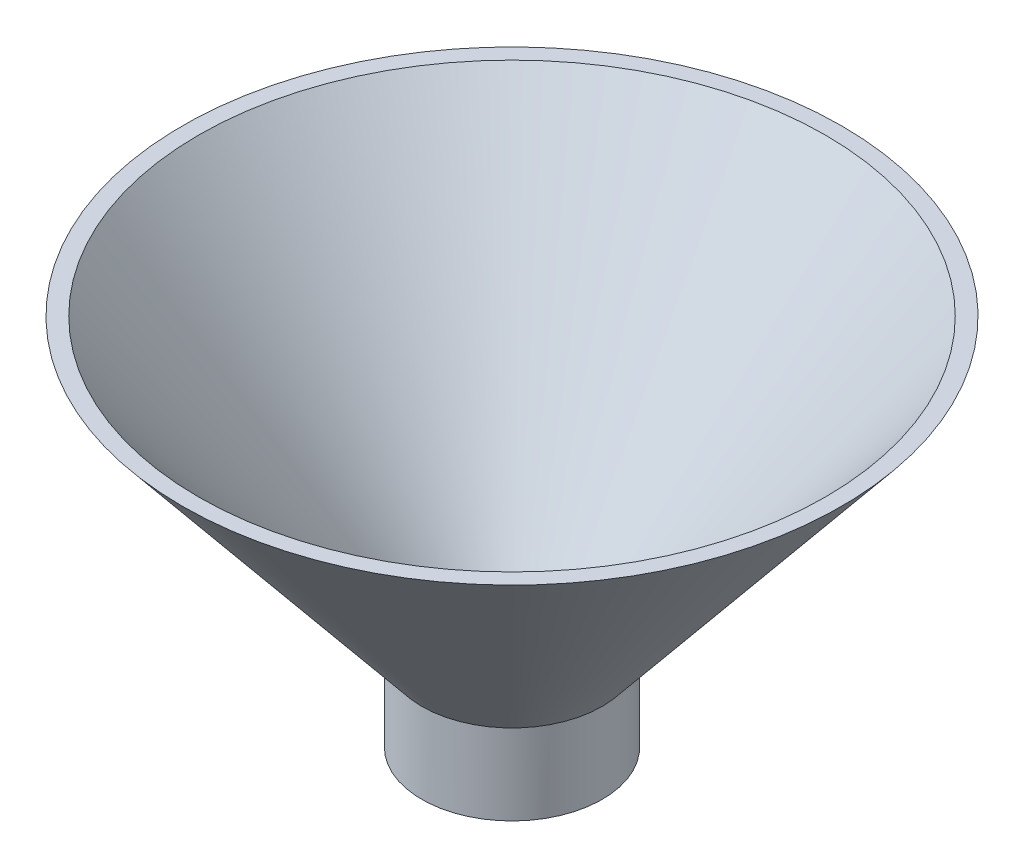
ISO-10303-21;
HEADER;
FILE_DESCRIPTION(('STEP AP214'),'2;1');
FILE_NAME('part.step','',(''),(''),'','','');
FILE_SCHEMA(('AUTOMOTIVE_DESIGN { 1 0 10303 214 1 1 1 1 }'));
ENDSEC;
DATA;
#1=APPLICATION_CONTEXT('core data for automotive mechanical design processes');
#2=APPLICATION_PROTOCOL_DEFINITION('international standard','automotive_design',2000,#1);
#3=PRODUCT_CONTEXT('',#1,'mechanical');
#4=PRODUCT('Part','Part','',(#3));
#5=PRODUCT_RELATED_PRODUCT_CATEGORY('part','',(#4));
#6=PRODUCT_DEFINITION_FORMATION('','',#4);
#7=PRODUCT_DEFINITION_CONTEXT('part definition',#1,'design');
#8=PRODUCT_DEFINITION('design','',#6,#7);
#9=PRODUCT_DEFINITION_SHAPE('','',#8);
#10=(LENGTH_UNIT() NAMED_UNIT(*) SI_UNIT(.MILLI.,.METRE.));
#11=(NAMED_UNIT(*) PLANE_ANGLE_UNIT() SI_UNIT($,.RADIAN.));
#12=(NAMED_UNIT(*) SI_UNIT($,.STERADIAN.) SOLID_ANGLE_UNIT());
#13=UNCERTAINTY_MEASURE_WITH_UNIT(LENGTH_MEASURE(1.E-05),#10,'distance_accuracy_value','');
#14=(GEOMETRIC_REPRESENTATION_CONTEXT(3) GLOBAL_UNCERTAINTY_ASSIGNED_CONTEXT((#13)) GLOBAL_UNIT_ASSIGNED_CONTEXT((#10,
#11,#12)) REPRESENTATION_CONTEXT('',''));
#15=CARTESIAN_POINT('',(0.,0.,0.));
#16=DIRECTION('',(0.,0.,1.));
#17=DIRECTION('',(1.,0.,0.));
#18=AXIS2_PLACEMENT_3D('',#15,#16,#17);
#19=CARTESIAN_POINT('',(7.82569741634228,11.8312531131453,0.));
#20=DIRECTION('',(0.,-1.,0.));
#21=DIRECTION('',(0.,0.,-1.));
#22=AXIS2_PLACEMENT_3D('',#19,#20,#21);
#23=PLANE('',#22);
#24=CARTESIAN_POINT('',(0.,11.8312531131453,0.));
#25=DIRECTION('',(0.,-1.,0.));
#26=DIRECTION('',(0.,0.,-1.));
#27=AXIS2_PLACEMENT_3D('',#24,#25,#26);
#28=CIRCLE('',#27,7.82569741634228);
#29=CARTESIAN_POINT('',(0.,11.8312531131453,-7.82569741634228));
#30=VERTEX_POINT('',#29);
#31=EDGE_CURVE('E50',#30,#30,#28,.T.);
#32=ORIENTED_EDGE('',*,*,#31,.T.);
#33=EDGE_LOOP('',(#32));
#34=FACE_BOUND('',#33,.T.);
#35=CARTESIAN_POINT('',(0.,11.8312531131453,0.));
#36=DIRECTION('',(0.,-1.,0.));
#37=DIRECTION('',(0.,0.,-1.));
#38=AXIS2_PLACEMENT_3D('',#35,#36,#37);
#39=CIRCLE('',#38,6.35);
#40=CARTESIAN_POINT('',(0.,11.8312531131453,-6.35));
#41=VERTEX_POINT('',#40);
#42=EDGE_CURVE('E10',#41,#41,#39,.T.);
#43=ORIENTED_EDGE('',*,*,#42,.F.);
#44=EDGE_LOOP('',(#43));
#45=FACE_BOUND('',#44,.T.);
#46=ADVANCED_FACE('F28',(#34,#45),#23,.T.);
#47=CARTESIAN_POINT('',(0.,18.2519502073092,0.));
#48=DIRECTION('',(0.,-1.,0.));
#49=DIRECTION('',(0.,0.,-1.));
#50=AXIS2_PLACEMENT_3D('',#47,#48,#49);
#51=CYLINDRICAL_SURFACE('',#50,6.35);
#52=ORIENTED_EDGE('',*,*,#42,.T.);
#53=EDGE_LOOP('',(#52));
#54=FACE_BOUND('',#53,.T.);
#55=CARTESIAN_POINT('',(0.,18.8162531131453,0.));
#56=DIRECTION('',(0.,-1.,0.));
#57=DIRECTION('',(0.,0.,-1.));
#58=AXIS2_PLACEMENT_3D('',#55,#56,#57);
#59=CIRCLE('',#58,6.35);
#60=CARTESIAN_POINT('',(0.,18.8162531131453,6.35));
#61=VERTEX_POINT('',#60);
#62=EDGE_CURVE('E34',#61,#61,#59,.T.);
#63=ORIENTED_EDGE('',*,*,#62,.F.);
#64=EDGE_LOOP('',(#63));
#65=FACE_BOUND('',#64,.T.);
#66=ADVANCED_FACE('F68',(#54,#65),#51,.F.);
#67=CARTESIAN_POINT('',(0.,44.2162531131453,0.));
#68=DIRECTION('',(0.,1.,0.));
#69=DIRECTION('',(0.,0.,1.));
#70=AXIS2_PLACEMENT_3D('',#67,#68,#69);
#71=CONICAL_SURFACE('',#70,27.178,0.686817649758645);
#72=CARTESIAN_POINT('',(0.,44.2162531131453,0.));
#73=DIRECTION('',(0.,-1.,0.));
#74=DIRECTION('',(0.,0.,-1.));
#75=AXIS2_PLACEMENT_3D('',#72,#73,#74);
#76=CIRCLE('',#75,27.178);
#77=CARTESIAN_POINT('',(0.,44.2162531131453,27.178));
#78=VERTEX_POINT('',#77);
#79=EDGE_CURVE('E38',#78,#78,#76,.T.);
#80=CARTESIAN_POINT('',(0.,18.8162531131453,6.35));
#81=CARTESIAN_POINT('',(0.,19.0808364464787,6.56695833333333));
#82=CARTESIAN_POINT('',(0.,19.345419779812,6.78391666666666));
#83=CARTESIAN_POINT('',(0.,19.8745864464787,7.21783333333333));
#84=CARTESIAN_POINT('',(0.,20.139169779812,7.43479166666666));
#85=CARTESIAN_POINT('',(0.,20.6683364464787,7.86870833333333));
#86=CARTESIAN_POINT('',(0.,20.932919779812,8.08566666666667));
#87=CARTESIAN_POINT('',(0.,21.4620864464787,8.51958333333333));
#88=CARTESIAN_POINT('',(0.,21.726669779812,8.73654166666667));
#89=CARTESIAN_POINT('',(0.,22.2558364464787,9.17045833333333));
#90=CARTESIAN_POINT('',(0.,22.520419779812,9.38741666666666));
#91=CARTESIAN_POINT('',(0.,23.0495864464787,9.82133333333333));
#92=CARTESIAN_POINT('',(0.,23.314169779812,10.0382916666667));
#93=CARTESIAN_POINT('',(0.,23.8433364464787,10.4722083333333));
#94=CARTESIAN_POINT('',(0.,24.107919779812,10.6891666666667));
#95=CARTESIAN_POINT('',(0.,24.6370864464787,11.1230833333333));
#96=CARTESIAN_POINT('',(0.,24.901669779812,11.3400416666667));
#97=CARTESIAN_POINT('',(0.,25.4308364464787,11.7739583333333));
#98=CARTESIAN_POINT('',(0.,25.695419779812,11.9909166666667));
#99=CARTESIAN_POINT('',(0.,26.2245864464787,12.4248333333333));
#100=CARTESIAN_POINT('',(0.,26.489169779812,12.6417916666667));
#101=CARTESIAN_POINT('',(0.,27.0183364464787,13.0757083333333));
#102=CARTESIAN_POINT('',(0.,27.282919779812,13.2926666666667));
#103=CARTESIAN_POINT('',(0.,27.8120864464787,13.7265833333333));
#104=CARTESIAN_POINT('',(0.,28.076669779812,13.9435416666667));
#105=CARTESIAN_POINT('',(0.,28.6058364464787,14.3774583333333));
#106=CARTESIAN_POINT('',(0.,28.870419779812,14.5944166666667));
#107=CARTESIAN_POINT('',(0.,29.3995864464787,15.0283333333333));
#108=CARTESIAN_POINT('',(0.,29.664169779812,15.2452916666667));
#109=CARTESIAN_POINT('',(0.,30.1933364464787,15.6792083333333));
#110=CARTESIAN_POINT('',(0.,30.457919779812,15.8961666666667));
#111=CARTESIAN_POINT('',(0.,30.9870864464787,16.3300833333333));
#112=CARTESIAN_POINT('',(0.,31.251669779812,16.5470416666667));
#113=CARTESIAN_POINT('',(0.,31.7808364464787,16.9809583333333));
#114=CARTESIAN_POINT('',(0.,32.045419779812,17.1979166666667));
#115=CARTESIAN_POINT('',(0.,32.5745864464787,17.6318333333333));
#116=CARTESIAN_POINT('',(0.,32.839169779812,17.8487916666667));
#117=CARTESIAN_POINT('',(0.,33.3683364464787,18.2827083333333));
#118=CARTESIAN_POINT('',(0.,33.632919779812,18.4996666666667));
#119=CARTESIAN_POINT('',(0.,34.1620864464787,18.9335833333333));
#120=CARTESIAN_POINT('',(0.,34.426669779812,19.1505416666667));
#121=CARTESIAN_POINT('',(0.,34.9558364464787,19.5844583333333));
#122=CARTESIAN_POINT('',(0.,35.220419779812,19.8014166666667));
#123=CARTESIAN_POINT('',(0.,35.7495864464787,20.2353333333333));
#124=CARTESIAN_POINT('',(0.,36.014169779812,20.4522916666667));
#125=CARTESIAN_POINT('',(0.,36.5433364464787,20.8862083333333));
#126=CARTESIAN_POINT('',(0.,36.807919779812,21.1031666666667));
#127=CARTESIAN_POINT('',(0.,37.3370864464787,21.5370833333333));
#128=CARTESIAN_POINT('',(0.,37.601669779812,21.7540416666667));
#129=CARTESIAN_POINT('',(0.,38.1308364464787,22.1879583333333));
#130=CARTESIAN_POINT('',(0.,38.395419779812,22.4049166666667));
#131=CARTESIAN_POINT('',(0.,38.9245864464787,22.8388333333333));
#132=CARTESIAN_POINT('',(0.,39.189169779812,23.0557916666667));
#133=CARTESIAN_POINT('',(0.,39.7183364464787,23.4897083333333));
#134=CARTESIAN_POINT('',(0.,39.982919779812,23.7066666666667));
#135=CARTESIAN_POINT('',(0.,40.5120864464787,24.1405833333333));
#136=CARTESIAN_POINT('',(0.,40.776669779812,24.3575416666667));
#137=CARTESIAN_POINT('',(0.,41.3058364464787,24.7914583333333));
#138=CARTESIAN_POINT('',(0.,41.570419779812,25.0084166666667));
#139=CARTESIAN_POINT('',(0.,42.0995864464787,25.4423333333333));
#140=CARTESIAN_POINT('',(0.,42.364169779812,25.6592916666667));
#141=CARTESIAN_POINT('',(0.,42.8933364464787,26.0932083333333));
#142=CARTESIAN_POINT('',(0.,43.157919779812,26.3101666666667));
#143=CARTESIAN_POINT('',(0.,43.6870864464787,26.7440833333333));
#144=CARTESIAN_POINT('',(0.,43.951669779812,26.9610416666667));
#145=CARTESIAN_POINT('',(0.,44.2162531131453,27.178));
#146=B_SPLINE_CURVE_WITH_KNOTS('',3,(#80,#81,#82,#83,#84,#85,#86,#87,#88,#89,#90,#91,#92,#93,
#94,#95,#96,#97,#98,#99,#100,#101,#102,#103,#104,#105,#106,#107,#108,#109,#110,#111,#112,#113,
#114,#115,#116,#117,#118,#119,#120,#121,#122,#123,#124,#125,#126,#127,#128,#129,#130,#131,#132,
#133,#134,#135,#136,#137,#138,#139,#140,#141,#142,#143,#144,#145),.UNSPECIFIED.,.F.,.F.,(4,2,2,
2,2,2,2,2,2,2,2,2,2,2,2,2,2,2,2,2,2,2,2,2,2,2,2,2,2,2,2,2,4),(0.,1.02648786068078,
2.05297572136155,3.07946358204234,4.10595144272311,5.13243930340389,6.15892716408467,
7.18541502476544,8.21190288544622,9.238390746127,10.2648786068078,11.2913664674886,
12.3178543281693,13.3443421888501,14.3708300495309,15.3973179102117,16.4238057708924,
17.4502936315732,18.476781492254,19.5032693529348,20.5297572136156,21.5562450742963,
22.5827329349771,23.6092207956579,24.6357086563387,25.6621965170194,26.6886843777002,
27.715172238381,28.7416600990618,29.7681479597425,30.7946358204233,31.8211236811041,
32.8476115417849),.UNSPECIFIED.);
#147=EDGE_CURVE('BSEAM72',#61,#78,#146,.T.);
#148=ORIENTED_EDGE('',*,*,#62,.T.);
#149=ORIENTED_EDGE('',*,*,#79,.F.);
#150=ORIENTED_EDGE('',*,*,#147,.T.);
#151=ORIENTED_EDGE('',*,*,#147,.F.);
#152=EDGE_LOOP('',(#148,#150,#149,#151));
#153=FACE_BOUND('',#152,.T.);
#154=ADVANCED_FACE('F72',(#153),#71,.F.);
#155=CARTESIAN_POINT('',(27.178,44.2162531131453,0.));
#156=DIRECTION('',(0.,1.,0.));
#157=DIRECTION('',(0.,0.,1.));
#158=AXIS2_PLACEMENT_3D('',#155,#156,#157);
#159=PLANE('',#158);
#160=ORIENTED_EDGE('',*,*,#79,.T.);
#161=EDGE_LOOP('',(#160));
#162=FACE_BOUND('',#161,.T.);
#163=CARTESIAN_POINT('',(0.,44.2162531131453,0.));
#164=DIRECTION('',(0.,-1.,0.));
#165=DIRECTION('',(0.,0.,-1.));
#166=AXIS2_PLACEMENT_3D('',#163,#164,#165);
#167=CIRCLE('',#166,28.575);
#168=CARTESIAN_POINT('',(0.,44.2162531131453,28.575));
#169=VERTEX_POINT('',#168);
#170=EDGE_CURVE('E42',#169,#169,#167,.T.);
#171=ORIENTED_EDGE('',*,*,#170,.F.);
#172=EDGE_LOOP('',(#171));
#173=FACE_BOUND('',#172,.T.);
#174=ADVANCED_FACE('F64',(#162,#173),#159,.T.);
#175=CARTESIAN_POINT('',(0.,18.8162531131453,0.));
#176=DIRECTION('',(0.,1.,0.));
#177=DIRECTION('',(0.,0.,1.));
#178=AXIS2_PLACEMENT_3D('',#175,#176,#177);
#179=CONICAL_SURFACE('',#178,7.82569741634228,0.68496221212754);
#180=CARTESIAN_POINT('',(0.,18.8162531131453,0.));
#181=DIRECTION('',(0.,-1.,0.));
#182=DIRECTION('',(0.,0.,-1.));
#183=AXIS2_PLACEMENT_3D('',#180,#181,#182);
#184=CIRCLE('',#183,7.82569741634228);
#185=CARTESIAN_POINT('',(0.,18.8162531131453,7.82569741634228));
#186=VERTEX_POINT('',#185);
#187=EDGE_CURVE('E47',#186,#186,#184,.T.);
#188=CARTESIAN_POINT('',(0.,44.2162531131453,28.575));
#189=CARTESIAN_POINT('',(0.,43.951669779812,28.3588614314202));
#190=CARTESIAN_POINT('',(0.,43.6870864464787,28.1427228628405));
#191=CARTESIAN_POINT('',(0.,43.157919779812,27.7104457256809));
#192=CARTESIAN_POINT('',(0.,42.8933364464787,27.4943071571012));
#193=CARTESIAN_POINT('',(0.,42.364169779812,27.0620300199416));
#194=CARTESIAN_POINT('',(0.,42.0995864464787,26.8458914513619));
#195=CARTESIAN_POINT('',(0.,41.570419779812,26.4136143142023));
#196=CARTESIAN_POINT('',(0.,41.3058364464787,26.1974757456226));
#197=CARTESIAN_POINT('',(0.,40.776669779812,25.765198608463));
#198=CARTESIAN_POINT('',(0.,40.5120864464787,25.5490600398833));
#199=CARTESIAN_POINT('',(0.,39.982919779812,25.1167829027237));
#200=CARTESIAN_POINT('',(0.,39.7183364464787,24.9006443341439));
#201=CARTESIAN_POINT('',(0.,39.189169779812,24.4683671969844));
#202=CARTESIAN_POINT('',(0.,38.9245864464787,24.2522286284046));
#203=CARTESIAN_POINT('',(0.,38.395419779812,23.8199514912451));
#204=CARTESIAN_POINT('',(0.,38.1308364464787,23.6038129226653));
#205=CARTESIAN_POINT('',(0.,37.601669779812,23.1715357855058));
#206=CARTESIAN_POINT('',(0.,37.3370864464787,22.955397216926));
#207=CARTESIAN_POINT('',(0.,36.807919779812,22.5231200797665));
#208=CARTESIAN_POINT('',(0.,36.5433364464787,22.3069815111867));
#209=CARTESIAN_POINT('',(0.,36.014169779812,21.8747043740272));
#210=CARTESIAN_POINT('',(0.,35.7495864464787,21.6585658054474));
#211=CARTESIAN_POINT('',(0.,35.220419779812,21.2262886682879));
#212=CARTESIAN_POINT('',(0.,34.9558364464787,21.0101500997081));
#213=CARTESIAN_POINT('',(0.,34.426669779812,20.5778729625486));
#214=CARTESIAN_POINT('',(0.,34.1620864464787,20.3617343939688));
#215=CARTESIAN_POINT('',(0.,33.632919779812,19.9294572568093));
#216=CARTESIAN_POINT('',(0.,33.3683364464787,19.7133186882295));
#217=CARTESIAN_POINT('',(0.,32.839169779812,19.28104155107));
#218=CARTESIAN_POINT('',(0.,32.5745864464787,19.0649029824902));
#219=CARTESIAN_POINT('',(0.,32.045419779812,18.6326258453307));
#220=CARTESIAN_POINT('',(0.,31.7808364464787,18.4164872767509));
#221=CARTESIAN_POINT('',(0.,31.251669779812,17.9842101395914));
#222=CARTESIAN_POINT('',(0.,30.9870864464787,17.7680715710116));
#223=CARTESIAN_POINT('',(0.,30.457919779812,17.3357944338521));
#224=CARTESIAN_POINT('',(0.,30.1933364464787,17.1196558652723));
#225=CARTESIAN_POINT('',(0.,29.664169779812,16.6873787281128));
#226=CARTESIAN_POINT('',(0.,29.3995864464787,16.471240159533));
#227=CARTESIAN_POINT('',(0.,28.870419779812,16.0389630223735));
#228=CARTESIAN_POINT('',(0.,28.6058364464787,15.8228244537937));
#229=CARTESIAN_POINT('',(0.,28.076669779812,15.3905473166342));
#230=CARTESIAN_POINT('',(0.,27.8120864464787,15.1744087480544));
#231=CARTESIAN_POINT('',(0.,27.282919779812,14.7421316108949));
#232=CARTESIAN_POINT('',(0.,27.0183364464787,14.5259930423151));
#233=CARTESIAN_POINT('',(0.,26.489169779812,14.0937159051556));
#234=CARTESIAN_POINT('',(0.,26.2245864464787,13.8775773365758));
#235=CARTESIAN_POINT('',(0.,25.695419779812,13.4453001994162));
#236=CARTESIAN_POINT('',(0.,25.4308364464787,13.2291616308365));
#237=CARTESIAN_POINT('',(0.,24.901669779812,12.7968844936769));
#238=CARTESIAN_POINT('',(0.,24.6370864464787,12.5807459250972));
#239=CARTESIAN_POINT('',(0.,24.107919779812,12.1484687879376));
#240=CARTESIAN_POINT('',(0.,23.8433364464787,11.9323302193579));
#241=CARTESIAN_POINT('',(0.,23.314169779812,11.5000530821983));
#242=CARTESIAN_POINT('',(0.,23.0495864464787,11.2839145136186));
#243=CARTESIAN_POINT('',(0.,22.520419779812,10.851637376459));
#244=CARTESIAN_POINT('',(0.,22.2558364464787,10.6354988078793));
#245=CARTESIAN_POINT('',(0.,21.726669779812,10.2032216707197));
#246=CARTESIAN_POINT('',(0.,21.4620864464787,9.98708310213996));
#247=CARTESIAN_POINT('',(0.,20.932919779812,9.55480596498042));
#248=CARTESIAN_POINT('',(0.,20.6683364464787,9.33866739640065));
#249=CARTESIAN_POINT('',(0.,20.139169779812,8.90639025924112));
#250=CARTESIAN_POINT('',(0.,19.8745864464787,8.69025169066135));
#251=CARTESIAN_POINT('',(0.,19.345419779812,8.25797455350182));
#252=CARTESIAN_POINT('',(0.,19.0808364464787,8.04183598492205));
#253=CARTESIAN_POINT('',(0.,18.8162531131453,7.82569741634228));
#254=B_SPLINE_CURVE_WITH_KNOTS('',3,(#188,#189,#190,#191,#192,#193,#194,#195,#196,#197,#198,
#199,#200,#201,#202,#203,#204,#205,#206,#207,#208,#209,#210,#211,#212,#213,#214,#215,#216,#217,
#218,#219,#220,#221,#222,#223,#224,#225,#226,#227,#228,#229,#230,#231,#232,#233,#234,#235,#236,
#237,#238,#239,#240,#241,#242,#243,#244,#245,#246,#247,#248,#249,#250,#251,#252,#253),
.UNSPECIFIED.,.F.,.F.,(4,2,2,2,2,2,2,2,2,2,2,2,2,2,2,2,2,2,2,2,2,2,2,2,2,2,2,2,2,2,2,2,4),(0.,
1.0249302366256,2.04986047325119,3.07479070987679,4.09972094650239,5.12465118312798,
6.14958141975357,7.17451165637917,8.19944189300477,9.22437212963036,10.249302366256,
11.2742326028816,12.2991628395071,13.3240930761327,14.3490233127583,15.3739535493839,
16.3988837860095,17.4238140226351,18.4487442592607,19.4736744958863,20.4986047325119,
21.5235349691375,22.5484652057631,23.5733954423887,24.5983256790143,25.6232559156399,
26.6481861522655,27.6731163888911,28.6980466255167,29.7229768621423,30.7479070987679,
31.7728373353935,32.7977675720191),.UNSPECIFIED.);
#255=EDGE_CURVE('BSEAM58',#169,#186,#254,.T.);
#256=ORIENTED_EDGE('',*,*,#170,.T.);
#257=ORIENTED_EDGE('',*,*,#187,.F.);
#258=ORIENTED_EDGE('',*,*,#255,.T.);
#259=ORIENTED_EDGE('',*,*,#255,.F.);
#260=EDGE_LOOP('',(#256,#258,#257,#259));
#261=FACE_BOUND('',#260,.T.);
#262=ADVANCED_FACE('F58',(#261),#179,.T.);
#263=CARTESIAN_POINT('',(0.,18.2519502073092,0.));
#264=DIRECTION('',(0.,-1.,0.));
#265=DIRECTION('',(0.,0.,-1.));
#266=AXIS2_PLACEMENT_3D('',#263,#264,#265);
#267=CYLINDRICAL_SURFACE('',#266,7.82569741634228);
#268=ORIENTED_EDGE('',*,*,#187,.T.);
#269=EDGE_LOOP('',(#268));
#270=FACE_BOUND('',#269,.T.);
#271=ORIENTED_EDGE('',*,*,#31,.F.);
#272=EDGE_LOOP('',(#271));
#273=FACE_BOUND('',#272,.T.);
#274=ADVANCED_FACE('F56',(#270,#273),#267,.T.);
#275=CLOSED_SHELL('',(#46,#66,#154,#174,#262,#274));
#276=MANIFOLD_SOLID_BREP('B2',#275);
#277=ADVANCED_BREP_SHAPE_REPRESENTATION('',(#18,#276),#14);
#278=SHAPE_DEFINITION_REPRESENTATION(#9,#277);
ENDSEC;
END-ISO-10303-21;
